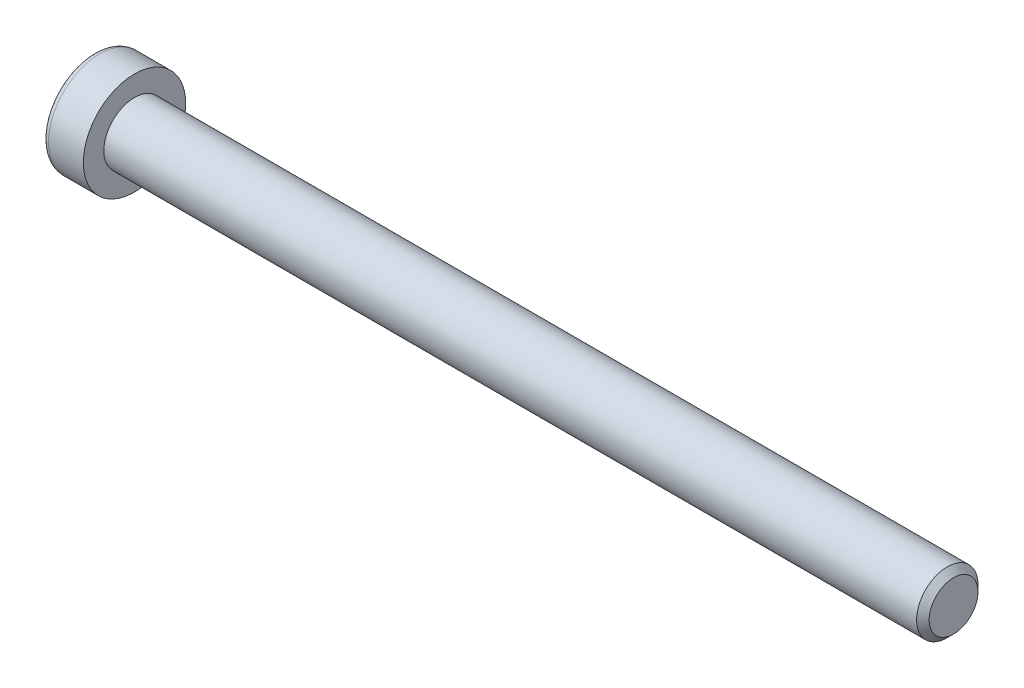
ISO-10303-21;
HEADER;
FILE_DESCRIPTION(('STEP AP214'),'2;1');
FILE_NAME('part.step','',(''),(''),'','','');
FILE_SCHEMA(('AUTOMOTIVE_DESIGN { 1 0 10303 214 1 1 1 1 }'));
ENDSEC;
DATA;
#1=APPLICATION_CONTEXT('core data for automotive mechanical design processes');
#2=APPLICATION_PROTOCOL_DEFINITION('international standard','automotive_design',2000,#1);
#3=PRODUCT_CONTEXT('',#1,'mechanical');
#4=PRODUCT('Part','Part','',(#3));
#5=PRODUCT_RELATED_PRODUCT_CATEGORY('part','',(#4));
#6=PRODUCT_DEFINITION_FORMATION('','',#4);
#7=PRODUCT_DEFINITION_CONTEXT('part definition',#1,'design');
#8=PRODUCT_DEFINITION('design','',#6,#7);
#9=PRODUCT_DEFINITION_SHAPE('','',#8);
#10=(LENGTH_UNIT() NAMED_UNIT(*) SI_UNIT(.MILLI.,.METRE.));
#11=(NAMED_UNIT(*) PLANE_ANGLE_UNIT() SI_UNIT($,.RADIAN.));
#12=(NAMED_UNIT(*) SI_UNIT($,.STERADIAN.) SOLID_ANGLE_UNIT());
#13=UNCERTAINTY_MEASURE_WITH_UNIT(LENGTH_MEASURE(1.E-05),#10,'distance_accuracy_value','');
#14=(GEOMETRIC_REPRESENTATION_CONTEXT(3) GLOBAL_UNCERTAINTY_ASSIGNED_CONTEXT((#13)) GLOBAL_UNIT_ASSIGNED_CONTEXT((#10,
#11,#12)) REPRESENTATION_CONTEXT('',''));
#15=CARTESIAN_POINT('',(0.,0.,0.));
#16=DIRECTION('',(0.,0.,1.));
#17=DIRECTION('',(1.,0.,0.));
#18=AXIS2_PLACEMENT_3D('',#15,#16,#17);
#19=CARTESIAN_POINT('',(-1.00800000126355,0.,0.));
#20=DIRECTION('',(-1.,0.,0.));
#21=DIRECTION('',(0.,0.,1.));
#22=AXIS2_PLACEMENT_3D('',#19,#20,#21);
#23=CONICAL_SURFACE('',#22,2.32325748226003,1.04719754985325);
#24=CARTESIAN_POINT('',(0.333333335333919,-1.70530256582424E-10,0.));
#25=VERTEX_POINT('',#24);
#26=VERTEX_LOOP('',#25);
#27=FACE_BOUND('',#26,.T.);
#28=CARTESIAN_POINT('',(-1.00000000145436,2.00000000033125,1.15470053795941));
#29=CARTESIAN_POINT('',(-0.970695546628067,2.00000000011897,1.05321634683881));
#30=CARTESIAN_POINT('',(-0.944044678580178,2.00000000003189,0.950856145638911));
#31=CARTESIAN_POINT('',(-0.897526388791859,1.99999999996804,0.744363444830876));
#32=CARTESIAN_POINT('',(-0.87767542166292,1.99999999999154,0.640227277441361));
#33=CARTESIAN_POINT('',(-0.846775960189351,2.00000000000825,0.433245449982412));
#34=CARTESIAN_POINT('',(-0.835521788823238,2.0000000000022,0.330431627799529));
#35=CARTESIAN_POINT('',(-0.822089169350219,1.9999999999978,0.124320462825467));
#36=CARTESIAN_POINT('',(-0.819899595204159,1.99999999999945,0.0210238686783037));
#37=CARTESIAN_POINT('',(-0.824466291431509,2.00000000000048,-0.171974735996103));
#38=CARTESIAN_POINT('',(-0.830101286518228,2.00000000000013,-0.261705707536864));
#39=CARTESIAN_POINT('',(-0.84795730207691,1.99999999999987,-0.440583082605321));
#40=CARTESIAN_POINT('',(-0.860184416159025,1.99999999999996,-0.529728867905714));
#41=CARTESIAN_POINT('',(-0.890749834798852,2.00000000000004,-0.708974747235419));
#42=CARTESIAN_POINT('',(-0.909217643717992,2.00000000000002,-0.799052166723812));
#43=CARTESIAN_POINT('',(-0.951131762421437,1.99999999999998,-0.977863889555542));
#44=CARTESIAN_POINT('',(-0.974568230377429,1.99999999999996,-1.06660048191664));
#45=CARTESIAN_POINT('',(-1.00000000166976,2.,-1.15470053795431));
#46=B_SPLINE_CURVE_WITH_KNOTS('',3,(#28,#29,#30,#31,#32,#33,#34,#35,#36,#37,#38,#39,#40,#41,#42,
#43,#44,#45),.UNSPECIFIED.,.F.,.F.,(4,2,2,2,2,2,2,2,4),(0.,0.317016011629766,0.63479381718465,
0.9447076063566,1.25424088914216,1.5237077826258,1.79342419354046,2.06912162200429,
2.34427797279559),.UNSPECIFIED.);
#47=CARTESIAN_POINT('',(-1.00000000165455,1.99999999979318,1.15470053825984));
#48=VERTEX_POINT('',#47);
#49=CARTESIAN_POINT('',(-1.00000000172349,2.,-1.15470053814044));
#50=VERTEX_POINT('',#49);
#51=EDGE_CURVE('E20',#48,#50,#46,.T.);
#52=ORIENTED_EDGE('',*,*,#51,.T.);
#53=CARTESIAN_POINT('',(-1.00000000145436,1.99999999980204,-1.15470053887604));
#54=CARTESIAN_POINT('',(-0.970695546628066,1.91211211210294,-1.2054426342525));
#55=CARTESIAN_POINT('',(-0.944044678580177,1.8234655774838,-1.25662273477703));
#56=CARTESIAN_POINT('',(-0.897526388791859,1.64463765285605,-1.35986908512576));
#57=CARTESIAN_POINT('',(-0.877675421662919,1.55445308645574,-1.41193716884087));
#58=CARTESIAN_POINT('',(-0.846775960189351,1.37520156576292,-1.51542808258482));
#59=CARTESIAN_POINT('',(-0.835521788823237,1.28616218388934,-1.56683499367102));
#60=CARTESIAN_POINT('',(-0.822089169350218,1.107664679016,-1.66989057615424));
#61=CARTESIAN_POINT('',(-0.819899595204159,1.01820720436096,-1.72153887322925));
#62=CARTESIAN_POINT('',(-0.824466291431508,0.851065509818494,-1.81803817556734));
#63=CARTESIAN_POINT('',(-0.830101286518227,0.773356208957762,-1.86290366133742));
#64=CARTESIAN_POINT('',(-0.847957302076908,0.618443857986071,-1.95234234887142));
#65=CARTESIAN_POINT('',(-0.860184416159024,0.541241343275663,-1.9969152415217));
#66=CARTESIAN_POINT('',(-0.890749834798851,0.386009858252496,-2.08653818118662));
#67=CARTESIAN_POINT('',(-0.90921764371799,0.30800052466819,-2.1315768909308));
#68=CARTESIAN_POINT('',(-0.951131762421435,0.153145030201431,-2.22098275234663));
#69=CARTESIAN_POINT('',(-0.974568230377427,0.0762968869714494,-2.26535104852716));
#70=CARTESIAN_POINT('',(-1.00000000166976,3.68008490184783E-10,-2.30940107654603));
#71=B_SPLINE_CURVE_WITH_KNOTS('',3,(#53,#54,#55,#56,#57,#58,#59,#60,#61,#62,#63,#64,#65,#66,#67,
#68,#69,#70),.UNSPECIFIED.,.F.,.F.,(4,2,2,2,2,2,2,2,4),(0.,0.317016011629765,0.63479381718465,
0.9447076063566,1.25424088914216,1.5237077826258,1.79342419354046,2.06912162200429,
2.34427797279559),.UNSPECIFIED.);
#72=CARTESIAN_POINT('',(-1.00000000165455,0.,-2.30940107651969));
#73=VERTEX_POINT('',#72);
#74=EDGE_CURVE('E80',#50,#73,#71,.T.);
#75=ORIENTED_EDGE('',*,*,#74,.T.);
#76=CARTESIAN_POINT('',(-1.00000000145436,-5.29216690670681E-10,-2.30940107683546));
#77=CARTESIAN_POINT('',(-0.970695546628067,-0.087887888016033,-2.25865898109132));
#78=CARTESIAN_POINT('',(-0.944044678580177,-0.176534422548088,-2.20747888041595));
#79=CARTESIAN_POINT('',(-0.897526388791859,-0.355362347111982,-2.10423252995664));
#80=CARTESIAN_POINT('',(-0.87767542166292,-0.445546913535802,-2.05216444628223));
#81=CARTESIAN_POINT('',(-0.846775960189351,-0.624798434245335,-1.94867353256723));
#82=CARTESIAN_POINT('',(-0.835521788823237,-0.713837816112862,-1.89726662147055));
#83=CARTESIAN_POINT('',(-0.822089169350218,-0.892335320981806,-1.79421103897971));
#84=CARTESIAN_POINT('',(-0.819899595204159,-0.981792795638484,-1.74256274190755));
#85=CARTESIAN_POINT('',(-0.824466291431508,-1.14893449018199,-1.64606343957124));
#86=CARTESIAN_POINT('',(-0.830101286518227,-1.22664379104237,-1.60119795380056));
#87=CARTESIAN_POINT('',(-0.847957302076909,-1.3815561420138,-1.51175926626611));
#88=CARTESIAN_POINT('',(-0.860184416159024,-1.4587586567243,-1.46718637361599));
#89=CARTESIAN_POINT('',(-0.890749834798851,-1.61399014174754,-1.3775634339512));
#90=CARTESIAN_POINT('',(-0.90921764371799,-1.69199947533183,-1.33252472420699));
#91=CARTESIAN_POINT('',(-0.951131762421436,-1.84685496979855,-1.24311886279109));
#92=CARTESIAN_POINT('',(-0.974568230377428,-1.92370311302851,-1.19875056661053));
#93=CARTESIAN_POINT('',(-1.00000000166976,-1.99999999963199,-1.15470053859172));
#94=B_SPLINE_CURVE_WITH_KNOTS('',3,(#76,#77,#78,#79,#80,#81,#82,#83,#84,#85,#86,#87,#88,#89,#90,
#91,#92,#93),.UNSPECIFIED.,.F.,.F.,(4,2,2,2,2,2,2,2,4),(0.,0.317016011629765,0.63479381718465,
0.9447076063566,1.25424088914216,1.5237077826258,1.79342419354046,2.06912162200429,
2.34427797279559),.UNSPECIFIED.);
#95=CARTESIAN_POINT('',(-1.00000000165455,-1.99999999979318,-1.15470053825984));
#96=VERTEX_POINT('',#95);
#97=EDGE_CURVE('E105',#73,#96,#94,.T.);
#98=ORIENTED_EDGE('',*,*,#97,.T.);
#99=CARTESIAN_POINT('',(-1.00000000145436,-2.00000000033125,-1.15470053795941));
#100=CARTESIAN_POINT('',(-0.970695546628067,-2.00000000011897,-1.05321634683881));
#101=CARTESIAN_POINT('',(-0.944044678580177,-2.00000000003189,-0.950856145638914));
#102=CARTESIAN_POINT('',(-0.897526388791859,-1.99999999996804,-0.744363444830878));
#103=CARTESIAN_POINT('',(-0.87767542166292,-1.99999999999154,-0.640227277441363));
#104=CARTESIAN_POINT('',(-0.846775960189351,-2.00000000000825,-0.433245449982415));
#105=CARTESIAN_POINT('',(-0.835521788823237,-2.0000000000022,-0.330431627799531));
#106=CARTESIAN_POINT('',(-0.822089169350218,-1.9999999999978,-0.124320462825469));
#107=CARTESIAN_POINT('',(-0.819899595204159,-1.99999999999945,-0.0210238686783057));
#108=CARTESIAN_POINT('',(-0.824466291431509,-2.00000000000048,0.171974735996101));
#109=CARTESIAN_POINT('',(-0.830101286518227,-2.00000000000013,0.261705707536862));
#110=CARTESIAN_POINT('',(-0.847957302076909,-1.99999999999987,0.440583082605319));
#111=CARTESIAN_POINT('',(-0.860184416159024,-1.99999999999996,0.529728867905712));
#112=CARTESIAN_POINT('',(-0.890749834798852,-2.00000000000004,0.708974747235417));
#113=CARTESIAN_POINT('',(-0.90921764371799,-2.00000000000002,0.79905216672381));
#114=CARTESIAN_POINT('',(-0.951131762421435,-1.99999999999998,0.97786388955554));
#115=CARTESIAN_POINT('',(-0.974568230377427,-1.99999999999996,1.06660048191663));
#116=CARTESIAN_POINT('',(-1.00000000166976,-2.,1.15470053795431));
#117=B_SPLINE_CURVE_WITH_KNOTS('',3,(#99,#100,#101,#102,#103,#104,#105,#106,#107,#108,#109,#110,
#111,#112,#113,#114,#115,#116),.UNSPECIFIED.,.F.,.F.,(4,2,2,2,2,2,2,2,4),(0.,0.317016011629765,
0.63479381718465,0.9447076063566,1.25424088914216,1.5237077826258,1.79342419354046,
2.06912162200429,2.34427797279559),.UNSPECIFIED.);
#118=CARTESIAN_POINT('',(-1.00000000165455,-1.99999999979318,1.15470053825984));
#119=VERTEX_POINT('',#118);
#120=EDGE_CURVE('E129',#96,#119,#117,.T.);
#121=ORIENTED_EDGE('',*,*,#120,.T.);
#122=CARTESIAN_POINT('',(-1.00000000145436,-1.99999999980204,1.15470053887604));
#123=CARTESIAN_POINT('',(-0.970695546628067,-1.91211211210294,1.2054426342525));
#124=CARTESIAN_POINT('',(-0.944044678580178,-1.8234655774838,1.25662273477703));
#125=CARTESIAN_POINT('',(-0.897526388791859,-1.64463765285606,1.35986908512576));
#126=CARTESIAN_POINT('',(-0.87767542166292,-1.55445308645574,1.41193716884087));
#127=CARTESIAN_POINT('',(-0.846775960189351,-1.37520156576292,1.51542808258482));
#128=CARTESIAN_POINT('',(-0.835521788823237,-1.28616218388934,1.56683499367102));
#129=CARTESIAN_POINT('',(-0.822089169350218,-1.107664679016,1.66989057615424));
#130=CARTESIAN_POINT('',(-0.819899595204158,-1.01820720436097,1.72153887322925));
#131=CARTESIAN_POINT('',(-0.824466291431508,-0.851065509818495,1.81803817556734));
#132=CARTESIAN_POINT('',(-0.830101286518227,-0.773356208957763,1.86290366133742));
#133=CARTESIAN_POINT('',(-0.847957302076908,-0.618443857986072,1.95234234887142));
#134=CARTESIAN_POINT('',(-0.860184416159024,-0.541241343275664,1.9969152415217));
#135=CARTESIAN_POINT('',(-0.890749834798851,-0.386009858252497,2.08653818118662));
#136=CARTESIAN_POINT('',(-0.90921764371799,-0.308000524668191,2.1315768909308));
#137=CARTESIAN_POINT('',(-0.951131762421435,-0.153145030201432,2.22098275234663));
#138=CARTESIAN_POINT('',(-0.974568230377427,-0.0762968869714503,2.26535104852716));
#139=CARTESIAN_POINT('',(-1.00000000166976,-3.68009330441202E-10,2.30940107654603));
#140=B_SPLINE_CURVE_WITH_KNOTS('',3,(#122,#123,#124,#125,#126,#127,#128,#129,#130,#131,#132,
#133,#134,#135,#136,#137,#138,#139),.UNSPECIFIED.,.F.,.F.,(4,2,2,2,2,2,2,2,4),(0.,
0.317016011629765,0.63479381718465,0.9447076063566,1.25424088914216,1.5237077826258,
1.79342419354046,2.06912162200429,2.34427797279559),.UNSPECIFIED.);
#141=CARTESIAN_POINT('',(-1.00000000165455,0.,2.30940107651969));
#142=VERTEX_POINT('',#141);
#143=EDGE_CURVE('E137',#119,#142,#140,.T.);
#144=ORIENTED_EDGE('',*,*,#143,.T.);
#145=CARTESIAN_POINT('',(-1.00000000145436,5.2921611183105E-10,2.30940107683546));
#146=CARTESIAN_POINT('',(-0.970695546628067,0.0878878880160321,2.25865898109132));
#147=CARTESIAN_POINT('',(-0.944044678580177,0.176534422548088,2.20747888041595));
#148=CARTESIAN_POINT('',(-0.897526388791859,0.355362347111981,2.10423252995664));
#149=CARTESIAN_POINT('',(-0.87767542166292,0.4455469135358,2.05216444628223));
#150=CARTESIAN_POINT('',(-0.846775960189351,0.624798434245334,1.94867353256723));
#151=CARTESIAN_POINT('',(-0.835521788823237,0.713837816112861,1.89726662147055));
#152=CARTESIAN_POINT('',(-0.822089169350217,0.892335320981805,1.79421103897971));
#153=CARTESIAN_POINT('',(-0.819899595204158,0.981792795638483,1.74256274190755));
#154=CARTESIAN_POINT('',(-0.824466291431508,1.14893449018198,1.64606343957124));
#155=CARTESIAN_POINT('',(-0.830101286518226,1.22664379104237,1.60119795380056));
#156=CARTESIAN_POINT('',(-0.847957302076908,1.3815561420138,1.5117592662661));
#157=CARTESIAN_POINT('',(-0.860184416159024,1.4587586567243,1.46718637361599));
#158=CARTESIAN_POINT('',(-0.890749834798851,1.61399014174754,1.3775634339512));
#159=CARTESIAN_POINT('',(-0.90921764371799,1.69199947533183,1.33252472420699));
#160=CARTESIAN_POINT('',(-0.951131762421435,1.84685496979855,1.24311886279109));
#161=CARTESIAN_POINT('',(-0.974568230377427,1.92370311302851,1.19875056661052));
#162=CARTESIAN_POINT('',(-1.00000000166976,1.99999999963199,1.15470053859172));
#163=B_SPLINE_CURVE_WITH_KNOTS('',3,(#145,#146,#147,#148,#149,#150,#151,#152,#153,#154,#155,
#156,#157,#158,#159,#160,#161,#162),.UNSPECIFIED.,.F.,.F.,(4,2,2,2,2,2,2,2,4),(0.,
0.317016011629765,0.63479381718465,0.944707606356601,1.25424088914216,1.5237077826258,
1.79342419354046,2.06912162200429,2.34427797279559),.UNSPECIFIED.);
#164=EDGE_CURVE('E82',#142,#48,#163,.T.);
#165=ORIENTED_EDGE('',*,*,#164,.T.);
#166=EDGE_LOOP('',(#52,#75,#98,#121,#144,#165));
#167=FACE_BOUND('',#166,.T.);
#168=ADVANCED_FACE('F16',(#27,#167),#23,.F.);
#169=CARTESIAN_POINT('',(-3.99999999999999,2.,1.15470053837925));
#170=DIRECTION('',(0.,1.,0.));
#171=DIRECTION('',(0.,0.,1.));
#172=AXIS2_PLACEMENT_3D('',#169,#170,#171);
#173=PLANE('',#172);
#174=DIRECTION('',(1.,0.,0.));
#175=VECTOR('',#174,1.);
#176=CARTESIAN_POINT('',(-3.99999999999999,2.,1.15470053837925));
#177=LINE('',#176,#175);
#178=CARTESIAN_POINT('',(-3.99999999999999,2.,1.15470053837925));
#179=VERTEX_POINT('',#178);
#180=EDGE_CURVE('E84',#48,#179,#177,.F.);
#181=ORIENTED_EDGE('',*,*,#180,.T.);
#182=DIRECTION('',(0.,0.,1.));
#183=VECTOR('',#182,1.);
#184=CARTESIAN_POINT('',(-3.99999999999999,2.,0.));
#185=LINE('',#184,#183);
#186=CARTESIAN_POINT('',(-3.99999999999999,2.,-1.15470053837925));
#187=VERTEX_POINT('',#186);
#188=EDGE_CURVE('E89',#187,#179,#185,.T.);
#189=ORIENTED_EDGE('',*,*,#188,.F.);
#190=DIRECTION('',(1.,0.,0.));
#191=VECTOR('',#190,1.);
#192=CARTESIAN_POINT('',(-3.99999999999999,2.,-1.15470053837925));
#193=LINE('',#192,#191);
#194=EDGE_CURVE('E87',#187,#50,#193,.T.);
#195=ORIENTED_EDGE('',*,*,#194,.T.);
#196=ORIENTED_EDGE('',*,*,#51,.F.);
#197=EDGE_LOOP('',(#181,#189,#195,#196));
#198=FACE_BOUND('',#197,.T.);
#199=ADVANCED_FACE('F76',(#198),#173,.F.);
#200=CARTESIAN_POINT('',(-3.99999999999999,0.,2.3094010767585));
#201=DIRECTION('',(0.,0.500000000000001,0.866025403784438));
#202=DIRECTION('',(0.,-0.866025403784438,0.500000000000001));
#203=AXIS2_PLACEMENT_3D('',#200,#201,#202);
#204=PLANE('',#203);
#205=DIRECTION('',(1.,0.,0.));
#206=VECTOR('',#205,1.);
#207=CARTESIAN_POINT('',(-3.99999999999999,0.,2.3094010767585));
#208=LINE('',#207,#206);
#209=CARTESIAN_POINT('',(-3.99999999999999,0.,2.3094010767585));
#210=VERTEX_POINT('',#209);
#211=EDGE_CURVE('E141',#142,#210,#208,.F.);
#212=ORIENTED_EDGE('',*,*,#211,.T.);
#213=DIRECTION('',(0.,-0.866025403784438,0.500000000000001));
#214=VECTOR('',#213,1.);
#215=CARTESIAN_POINT('',(-3.99999999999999,2.,1.15470053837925));
#216=LINE('',#215,#214);
#217=EDGE_CURVE('E95',#179,#210,#216,.T.);
#218=ORIENTED_EDGE('',*,*,#217,.F.);
#219=ORIENTED_EDGE('',*,*,#180,.F.);
#220=ORIENTED_EDGE('',*,*,#164,.F.);
#221=EDGE_LOOP('',(#212,#218,#219,#220));
#222=FACE_BOUND('',#221,.T.);
#223=ADVANCED_FACE('F145',(#222),#204,.F.);
#224=CARTESIAN_POINT('',(-3.99999999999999,-2.,1.15470053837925));
#225=DIRECTION('',(0.,-0.5,0.866025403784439));
#226=DIRECTION('',(0.,-0.866025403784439,-0.5));
#227=AXIS2_PLACEMENT_3D('',#224,#225,#226);
#228=PLANE('',#227);
#229=DIRECTION('',(1.,0.,0.));
#230=VECTOR('',#229,1.);
#231=CARTESIAN_POINT('',(-3.99999999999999,-2.,1.15470053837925));
#232=LINE('',#231,#230);
#233=CARTESIAN_POINT('',(-3.99999999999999,-2.,1.15470053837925));
#234=VERTEX_POINT('',#233);
#235=EDGE_CURVE('E136',#119,#234,#232,.F.);
#236=ORIENTED_EDGE('',*,*,#235,.T.);
#237=DIRECTION('',(0.,-0.866025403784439,-0.5));
#238=VECTOR('',#237,1.);
#239=CARTESIAN_POINT('',(-3.99999999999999,0.,2.3094010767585));
#240=LINE('',#239,#238);
#241=EDGE_CURVE('E224',#210,#234,#240,.T.);
#242=ORIENTED_EDGE('',*,*,#241,.F.);
#243=ORIENTED_EDGE('',*,*,#211,.F.);
#244=ORIENTED_EDGE('',*,*,#143,.F.);
#245=EDGE_LOOP('',(#236,#242,#243,#244));
#246=FACE_BOUND('',#245,.T.);
#247=ADVANCED_FACE('F125',(#246),#228,.F.);
#248=CARTESIAN_POINT('',(-3.99999999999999,-2.,-1.15470053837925));
#249=DIRECTION('',(0.,-1.,0.));
#250=DIRECTION('',(0.,0.,-1.));
#251=AXIS2_PLACEMENT_3D('',#248,#249,#250);
#252=PLANE('',#251);
#253=DIRECTION('',(1.,0.,0.));
#254=VECTOR('',#253,1.);
#255=CARTESIAN_POINT('',(-3.99999999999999,-2.,-1.15470053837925));
#256=LINE('',#255,#254);
#257=CARTESIAN_POINT('',(-3.99999999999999,-2.,-1.15470053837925));
#258=VERTEX_POINT('',#257);
#259=EDGE_CURVE('E135',#96,#258,#256,.F.);
#260=ORIENTED_EDGE('',*,*,#259,.T.);
#261=DIRECTION('',(0.,0.,1.));
#262=VECTOR('',#261,1.);
#263=CARTESIAN_POINT('',(-3.99999999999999,-2.,0.));
#264=LINE('',#263,#262);
#265=EDGE_CURVE('E221',#234,#258,#264,.F.);
#266=ORIENTED_EDGE('',*,*,#265,.F.);
#267=ORIENTED_EDGE('',*,*,#235,.F.);
#268=ORIENTED_EDGE('',*,*,#120,.F.);
#269=EDGE_LOOP('',(#260,#266,#267,#268));
#270=FACE_BOUND('',#269,.T.);
#271=ADVANCED_FACE('F121',(#270),#252,.F.);
#272=CARTESIAN_POINT('',(-3.99999999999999,0.,-2.3094010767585));
#273=DIRECTION('',(0.,-0.5,-0.866025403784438));
#274=DIRECTION('',(0.,0.866025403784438,-0.5));
#275=AXIS2_PLACEMENT_3D('',#272,#273,#274);
#276=PLANE('',#275);
#277=DIRECTION('',(1.,0.,0.));
#278=VECTOR('',#277,1.);
#279=CARTESIAN_POINT('',(-3.99999999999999,0.,-2.3094010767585));
#280=LINE('',#279,#278);
#281=CARTESIAN_POINT('',(-3.99999999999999,0.,-2.3094010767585));
#282=VERTEX_POINT('',#281);
#283=EDGE_CURVE('E38',#73,#282,#280,.F.);
#284=ORIENTED_EDGE('',*,*,#283,.T.);
#285=DIRECTION('',(0.,0.866025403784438,-0.5));
#286=VECTOR('',#285,1.);
#287=CARTESIAN_POINT('',(-3.99999999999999,-2.,-1.15470053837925));
#288=LINE('',#287,#286);
#289=EDGE_CURVE('E218',#258,#282,#288,.T.);
#290=ORIENTED_EDGE('',*,*,#289,.F.);
#291=ORIENTED_EDGE('',*,*,#259,.F.);
#292=ORIENTED_EDGE('',*,*,#97,.F.);
#293=EDGE_LOOP('',(#284,#290,#291,#292));
#294=FACE_BOUND('',#293,.T.);
#295=ADVANCED_FACE('F115',(#294),#276,.F.);
#296=CARTESIAN_POINT('',(-3.99999999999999,2.,-1.15470053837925));
#297=DIRECTION('',(0.,0.5,-0.866025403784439));
#298=DIRECTION('',(0.,0.866025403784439,0.5));
#299=AXIS2_PLACEMENT_3D('',#296,#297,#298);
#300=PLANE('',#299);
#301=ORIENTED_EDGE('',*,*,#194,.F.);
#302=DIRECTION('',(0.,0.866025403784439,0.5));
#303=VECTOR('',#302,1.);
#304=CARTESIAN_POINT('',(-3.99999999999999,0.,-2.3094010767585));
#305=LINE('',#304,#303);
#306=EDGE_CURVE('E216',#282,#187,#305,.T.);
#307=ORIENTED_EDGE('',*,*,#306,.F.);
#308=ORIENTED_EDGE('',*,*,#283,.F.);
#309=ORIENTED_EDGE('',*,*,#74,.F.);
#310=EDGE_LOOP('',(#301,#307,#308,#309));
#311=FACE_BOUND('',#310,.T.);
#312=ADVANCED_FACE('F93',(#311),#300,.F.);
#313=CARTESIAN_POINT('',(-3.99999999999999,3.65470053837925,0.));
#314=DIRECTION('',(-1.,0.,0.));
#315=DIRECTION('',(0.,0.,1.));
#316=AXIS2_PLACEMENT_3D('',#313,#314,#315);
#317=PLANE('',#316);
#318=ORIENTED_EDGE('',*,*,#289,.T.);
#319=ORIENTED_EDGE('',*,*,#306,.T.);
#320=ORIENTED_EDGE('',*,*,#188,.T.);
#321=ORIENTED_EDGE('',*,*,#217,.T.);
#322=ORIENTED_EDGE('',*,*,#241,.T.);
#323=ORIENTED_EDGE('',*,*,#265,.T.);
#324=EDGE_LOOP('',(#318,#319,#320,#321,#322,#323));
#325=FACE_BOUND('',#324,.T.);
#326=CARTESIAN_POINT('',(-3.99999999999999,0.,0.));
#327=DIRECTION('',(1.,0.,0.));
#328=DIRECTION('',(0.,1.,0.));
#329=AXIS2_PLACEMENT_3D('',#326,#327,#328);
#330=CIRCLE('',#329,4.4);
#331=CARTESIAN_POINT('',(-3.99999999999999,4.4,0.));
#332=VERTEX_POINT('',#331);
#333=EDGE_CURVE('E193',#332,#332,#330,.T.);
#334=ORIENTED_EDGE('',*,*,#333,.F.);
#335=EDGE_LOOP('',(#334));
#336=FACE_BOUND('',#335,.T.);
#337=ADVANCED_FACE('F114',(#325,#336),#317,.T.);
#338=CARTESIAN_POINT('',(-3.4,0.,0.));
#339=DIRECTION('',(1.,0.,0.));
#340=DIRECTION('',(0.,0.,-1.));
#341=AXIS2_PLACEMENT_3D('',#338,#339,#340);
#342=TOROIDAL_SURFACE('',#341,4.4,0.6);
#343=CARTESIAN_POINT('',(-3.4,0.,0.));
#344=DIRECTION('',(1.,0.,0.));
#345=DIRECTION('',(0.,1.,0.));
#346=AXIS2_PLACEMENT_3D('',#343,#344,#345);
#347=CIRCLE('',#346,5.);
#348=CARTESIAN_POINT('',(-3.4,5.,0.));
#349=VERTEX_POINT('',#348);
#350=EDGE_CURVE('E234',#349,#349,#347,.T.);
#351=ORIENTED_EDGE('',*,*,#350,.F.);
#352=EDGE_LOOP('',(#351));
#353=FACE_BOUND('',#352,.T.);
#354=ORIENTED_EDGE('',*,*,#333,.T.);
#355=EDGE_LOOP('',(#354));
#356=FACE_BOUND('',#355,.T.);
#357=ADVANCED_FACE('F177',(#353,#356),#342,.T.);
#358=CARTESIAN_POINT('',(-1.99999999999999,0.,0.));
#359=DIRECTION('',(1.,0.,0.));
#360=DIRECTION('',(0.,1.,0.));
#361=AXIS2_PLACEMENT_3D('',#358,#359,#360);
#362=CYLINDRICAL_SURFACE('',#361,5.);
#363=ORIENTED_EDGE('',*,*,#350,.T.);
#364=EDGE_LOOP('',(#363));
#365=FACE_BOUND('',#364,.T.);
#366=CARTESIAN_POINT('',(0.,0.,0.));
#367=DIRECTION('',(1.,0.,0.));
#368=DIRECTION('',(0.,1.,0.));
#369=AXIS2_PLACEMENT_3D('',#366,#367,#368);
#370=CIRCLE('',#369,5.);
#371=CARTESIAN_POINT('',(0.,5.,0.));
#372=VERTEX_POINT('',#371);
#373=EDGE_CURVE('E103',#372,#372,#370,.T.);
#374=ORIENTED_EDGE('',*,*,#373,.F.);
#375=EDGE_LOOP('',(#374));
#376=FACE_BOUND('',#375,.T.);
#377=ADVANCED_FACE('F174',(#365,#376),#362,.T.);
#378=CARTESIAN_POINT('',(80.,1.5,0.));
#379=DIRECTION('',(1.,0.,0.));
#380=DIRECTION('',(0.,0.,-1.));
#381=AXIS2_PLACEMENT_3D('',#378,#379,#380);
#382=PLANE('',#381);
#383=CARTESIAN_POINT('',(80.0000000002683,0.,0.));
#384=DIRECTION('',(-1.,0.,0.));
#385=DIRECTION('',(0.,0.,1.));
#386=AXIS2_PLACEMENT_3D('',#383,#384,#385);
#387=CIRCLE('',#386,2.38655000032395);
#388=CARTESIAN_POINT('',(80.0000000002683,0.,2.38655000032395));
#389=VERTEX_POINT('',#388);
#390=EDGE_CURVE('E230',#389,#389,#387,.T.);
#391=ORIENTED_EDGE('',*,*,#390,.F.);
#392=EDGE_LOOP('',(#391));
#393=FACE_BOUND('',#392,.T.);
#394=ADVANCED_FACE('F170',(#393),#382,.T.);
#395=CARTESIAN_POINT('',(0.,4.,0.));
#396=DIRECTION('',(1.,0.,0.));
#397=DIRECTION('',(0.,0.,-1.));
#398=AXIS2_PLACEMENT_3D('',#395,#396,#397);
#399=PLANE('',#398);
#400=CARTESIAN_POINT('',(0.,0.,0.));
#401=DIRECTION('',(1.,0.,0.));
#402=DIRECTION('',(0.,1.,0.));
#403=AXIS2_PLACEMENT_3D('',#400,#401,#402);
#404=CIRCLE('',#403,3.00000000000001);
#405=CARTESIAN_POINT('',(0.,3.00000000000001,0.));
#406=VERTEX_POINT('',#405);
#407=EDGE_CURVE('E29',#406,#406,#404,.T.);
#408=ORIENTED_EDGE('',*,*,#407,.F.);
#409=EDGE_LOOP('',(#408));
#410=FACE_BOUND('',#409,.T.);
#411=ORIENTED_EDGE('',*,*,#373,.T.);
#412=EDGE_LOOP('',(#411));
#413=FACE_BOUND('',#412,.T.);
#414=ADVANCED_FACE('F163',(#410,#413),#399,.T.);
#415=CARTESIAN_POINT('',(79.3865499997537,0.,0.));
#416=DIRECTION('',(-1.,0.,0.));
#417=DIRECTION('',(0.,0.,1.));
#418=AXIS2_PLACEMENT_3D('',#415,#416,#417);
#419=CONICAL_SURFACE('',#418,2.99999999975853,0.785398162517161);
#420=ORIENTED_EDGE('',*,*,#390,.T.);
#421=EDGE_LOOP('',(#420));
#422=FACE_BOUND('',#421,.T.);
#423=CARTESIAN_POINT('',(79.38655,0.,0.));
#424=DIRECTION('',(1.,0.,0.));
#425=DIRECTION('',(0.,1.,0.));
#426=AXIS2_PLACEMENT_3D('',#423,#424,#425);
#427=CIRCLE('',#426,3.00000000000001);
#428=CARTESIAN_POINT('',(79.38655,3.00000000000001,0.));
#429=VERTEX_POINT('',#428);
#430=EDGE_CURVE('E11',#429,#429,#427,.F.);
#431=ORIENTED_EDGE('',*,*,#430,.F.);
#432=EDGE_LOOP('',(#431));
#433=FACE_BOUND('',#432,.T.);
#434=ADVANCED_FACE('F156',(#422,#433),#419,.T.);
#435=CARTESIAN_POINT('',(71.,0.,0.));
#436=DIRECTION('',(1.,0.,0.));
#437=DIRECTION('',(0.,1.,0.));
#438=AXIS2_PLACEMENT_3D('',#435,#436,#437);
#439=CYLINDRICAL_SURFACE('',#438,3.00000000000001);
#440=ORIENTED_EDGE('',*,*,#430,.T.);
#441=EDGE_LOOP('',(#440));
#442=FACE_BOUND('',#441,.T.);
#443=ORIENTED_EDGE('',*,*,#407,.T.);
#444=EDGE_LOOP('',(#443));
#445=FACE_BOUND('',#444,.T.);
#446=ADVANCED_FACE('F154',(#442,#445),#439,.T.);
#447=CLOSED_SHELL('',(#168,#199,#223,#247,#271,#295,#312,#337,#357,#377,#394,#414,#434,#446));
#448=MANIFOLD_SOLID_BREP('B1',#447);
#449=ADVANCED_BREP_SHAPE_REPRESENTATION('',(#18,#448),#14);
#450=SHAPE_DEFINITION_REPRESENTATION(#9,#449);
ENDSEC;
END-ISO-10303-21;
